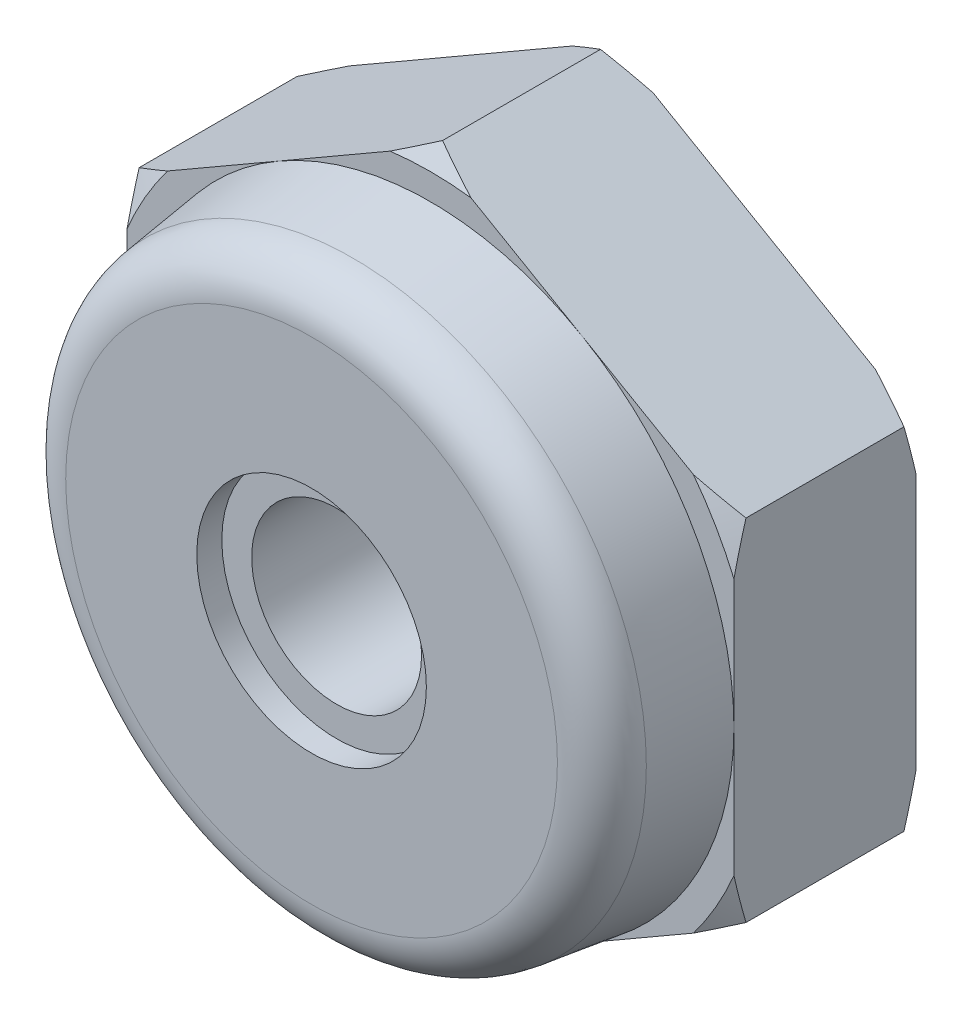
from build123d import *

# Parameters (mm, degrees)
BASENUTSKE_R  = 0.889
BASENUT_DEPTH = 1.905


with BuildPart() as part:
    # BaseNutSke → BaseNut (new body)
    with BuildSketch(Plane.XY):
        Polygon((3.175, -1.833087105), (3.175, 1.833087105), (0, 3.666174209), (-3.175, 1.833087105), (-3.175, -1.833087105), (0, -3.666174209), align=None)
        Circle(BASENUTSKE_R, mode=Mode.SUBTRACT)
    extrude(amount=-BASENUT_DEPTH)

    # TorqEleSke → TorqueElement (revolve)
    with BuildSketch(Plane(origin=(0, 0, 0), x_dir=(0, 0, -1), z_dir=(0, 1, 0)), mode=Mode.PRIVATE) as torqueelement_sk:
        with BuildLine():
            Line((-0.982472, 1.20142), (-0.982472, 0.889))
            Line((-0.982472, 0.889), (0, 0.889))
            Line((0, 0.889), (0, 3.175))
            Line((0, 3.175), (-0.809863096, 3.068379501))
            ThreePointArc((-0.809863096, 3.068379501), (-1.120519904, 2.902329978), (-1.2446, 2.57265707))
            Line((-1.2446, 2.57265707), (-1.2446, 1.20142))
            Line((-1.2446, 1.20142), (-0.982472, 1.20142))
        make_face()
    revolve(torqueelement_sk.sketch.rotate(Axis((0, 0, 9.480888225), (0, 0, -1)), 180), axis=Axis((0, 0, 9.480888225), (0, 0, -1)))

    # Sketch3 → DoubleChamfer (revolve, cut)
    with BuildSketch(Plane(origin=(0, 0, 0), x_dir=(0, 0, -1), z_dir=(1, 0, 0))):
        Polygon((1.905, 3.447734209), (1.778883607, 3.666174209), (1.905, 3.666174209), align=None)
        Polygon((0, 3.666174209), (0, 3.447734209), (0.126116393, 3.666174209), align=None)
    revolve(axis=Axis((0, 0, 0), (0, 0, -1)), mode=Mode.SUBTRACT)

    # ThdSchSke → ThreadSchematic (revolve, cut)
    with BuildSketch(Plane(origin=(0, 0, 0), x_dir=(1, 0, 0), z_dir=(0, 1, 0)), mode=Mode.PRIVATE) as threadschematic_sk:
        Polygon((-1.0922, 1.905), (-0.889, 2.022317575), (-0.889, 1.787682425), align=None)
    revolve(threadschematic_sk.sketch.rotate(Axis((0, 0, 1.481463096), (0, 0, 1)), 180), axis=Axis((0, 0, 1.481463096), (0, 0, 1)), mode=Mode.SUBTRACT)


solid = part.part
